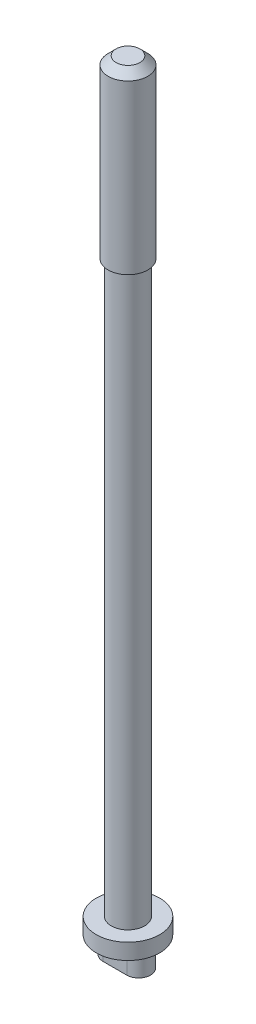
ISO-10303-21;
HEADER;
FILE_DESCRIPTION(('STEP AP214'),'2;1');
FILE_NAME('part.step','',(''),(''),'','','');
FILE_SCHEMA(('AUTOMOTIVE_DESIGN { 1 0 10303 214 1 1 1 1 }'));
ENDSEC;
DATA;
#1=APPLICATION_CONTEXT('core data for automotive mechanical design processes');
#2=APPLICATION_PROTOCOL_DEFINITION('international standard','automotive_design',2000,#1);
#3=PRODUCT_CONTEXT('',#1,'mechanical');
#4=PRODUCT('Part','Part','',(#3));
#5=PRODUCT_RELATED_PRODUCT_CATEGORY('part','',(#4));
#6=PRODUCT_DEFINITION_FORMATION('','',#4);
#7=PRODUCT_DEFINITION_CONTEXT('part definition',#1,'design');
#8=PRODUCT_DEFINITION('design','',#6,#7);
#9=PRODUCT_DEFINITION_SHAPE('','',#8);
#10=(LENGTH_UNIT() NAMED_UNIT(*) SI_UNIT(.MILLI.,.METRE.));
#11=(NAMED_UNIT(*) PLANE_ANGLE_UNIT() SI_UNIT($,.RADIAN.));
#12=(NAMED_UNIT(*) SI_UNIT($,.STERADIAN.) SOLID_ANGLE_UNIT());
#13=UNCERTAINTY_MEASURE_WITH_UNIT(LENGTH_MEASURE(1.E-05),#10,'distance_accuracy_value','');
#14=(GEOMETRIC_REPRESENTATION_CONTEXT(3) GLOBAL_UNCERTAINTY_ASSIGNED_CONTEXT((#13)) GLOBAL_UNIT_ASSIGNED_CONTEXT((#10,
#11,#12)) REPRESENTATION_CONTEXT('',''));
#15=CARTESIAN_POINT('',(0.,0.,0.));
#16=DIRECTION('',(0.,0.,1.));
#17=DIRECTION('',(1.,0.,0.));
#18=AXIS2_PLACEMENT_3D('',#15,#16,#17);
#19=CARTESIAN_POINT('',(-49.0306225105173,-89.7840104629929,0.));
#20=DIRECTION('',(0.,1.,0.));
#21=DIRECTION('',(0.,0.,1.));
#22=AXIS2_PLACEMENT_3D('',#19,#20,#21);
#23=PLANE('',#22);
#24=DIRECTION('',(1.,0.,0.));
#25=VECTOR('',#24,1.);
#26=CARTESIAN_POINT('',(-52.5566861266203,-89.7840104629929,1.50000000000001));
#27=LINE('',#26,#25);
#28=CARTESIAN_POINT('',(-52.5566861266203,-89.7840104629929,1.50000000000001));
#29=VERTEX_POINT('',#28);
#30=CARTESIAN_POINT('',(-49.5566861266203,-89.7840104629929,1.50000000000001));
#31=VERTEX_POINT('',#30);
#32=EDGE_CURVE('E57',#29,#31,#27,.T.);
#33=ORIENTED_EDGE('',*,*,#32,.F.);
#34=CARTESIAN_POINT('',(-52.5566861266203,-89.7840104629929,0.));
#35=DIRECTION('',(0.,-1.,0.));
#36=DIRECTION('',(0.,0.,-1.));
#37=AXIS2_PLACEMENT_3D('',#34,#35,#36);
#38=CIRCLE('',#37,1.5);
#39=CARTESIAN_POINT('',(-52.5566861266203,-89.7840104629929,-1.49999999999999));
#40=VERTEX_POINT('',#39);
#41=EDGE_CURVE('E20',#40,#29,#38,.F.);
#42=ORIENTED_EDGE('',*,*,#41,.F.);
#43=DIRECTION('',(-1.,0.,0.));
#44=VECTOR('',#43,1.);
#45=CARTESIAN_POINT('',(-49.5566861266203,-89.7840104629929,-1.49999999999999));
#46=LINE('',#45,#44);
#47=CARTESIAN_POINT('',(-49.5566861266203,-89.7840104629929,-1.49999999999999));
#48=VERTEX_POINT('',#47);
#49=EDGE_CURVE('E68',#48,#40,#46,.T.);
#50=ORIENTED_EDGE('',*,*,#49,.F.);
#51=CARTESIAN_POINT('',(-49.5566861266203,-89.7840104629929,0.));
#52=DIRECTION('',(0.,-1.,0.));
#53=DIRECTION('',(0.,0.,-1.));
#54=AXIS2_PLACEMENT_3D('',#51,#52,#53);
#55=CIRCLE('',#54,1.5);
#56=EDGE_CURVE('E59',#31,#48,#55,.F.);
#57=ORIENTED_EDGE('',*,*,#56,.F.);
#58=EDGE_LOOP('',(#33,#42,#50,#57));
#59=FACE_BOUND('',#58,.T.);
#60=ADVANCED_FACE('F16',(#59),#23,.F.);
#61=CARTESIAN_POINT('',(-49.5566861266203,-86.7840104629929,-1.49999999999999));
#62=DIRECTION('',(0.,0.,-1.));
#63=DIRECTION('',(-1.,0.,0.));
#64=AXIS2_PLACEMENT_3D('',#61,#62,#63);
#65=PLANE('',#64);
#66=DIRECTION('',(1.,0.,0.));
#67=VECTOR('',#66,1.);
#68=CARTESIAN_POINT('',(-52.9079596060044,-86.7840104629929,-1.49999999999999));
#69=LINE('',#68,#67);
#70=CARTESIAN_POINT('',(-49.5566861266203,-86.7840104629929,-1.49999999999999));
#71=VERTEX_POINT('',#70);
#72=CARTESIAN_POINT('',(-52.5566861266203,-86.7840104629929,-1.49999999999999));
#73=VERTEX_POINT('',#72);
#74=EDGE_CURVE('E99',#71,#73,#69,.F.);
#75=ORIENTED_EDGE('',*,*,#74,.F.);
#76=DIRECTION('',(0.,-1.,0.));
#77=VECTOR('',#76,1.);
#78=CARTESIAN_POINT('',(-49.5566861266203,-86.7840104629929,-1.49999999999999));
#79=LINE('',#78,#77);
#80=EDGE_CURVE('E74',#48,#71,#79,.F.);
#81=ORIENTED_EDGE('',*,*,#80,.F.);
#82=ORIENTED_EDGE('',*,*,#49,.T.);
#83=DIRECTION('',(0.,-1.,0.));
#84=VECTOR('',#83,1.);
#85=CARTESIAN_POINT('',(-52.5566861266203,-86.7840104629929,-1.49999999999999));
#86=LINE('',#85,#84);
#87=EDGE_CURVE('E62',#73,#40,#86,.T.);
#88=ORIENTED_EDGE('',*,*,#87,.F.);
#89=EDGE_LOOP('',(#75,#81,#82,#88));
#90=FACE_BOUND('',#89,.T.);
#91=ADVANCED_FACE('F196',(#90),#65,.T.);
#92=CARTESIAN_POINT('',(-52.5566861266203,-86.7840104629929,0.));
#93=DIRECTION('',(0.,-1.,0.));
#94=DIRECTION('',(0.,0.,-1.));
#95=AXIS2_PLACEMENT_3D('',#92,#93,#94);
#96=CYLINDRICAL_SURFACE('',#95,1.5);
#97=CARTESIAN_POINT('',(-52.5566861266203,-86.7840104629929,0.));
#98=DIRECTION('',(0.,-1.,0.));
#99=DIRECTION('',(0.,0.,-1.));
#100=AXIS2_PLACEMENT_3D('',#97,#98,#99);
#101=CIRCLE('',#100,1.5);
#102=CARTESIAN_POINT('',(-52.5566861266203,-86.7840104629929,1.50000000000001));
#103=VERTEX_POINT('',#102);
#104=EDGE_CURVE('E98',#73,#103,#101,.F.);
#105=ORIENTED_EDGE('',*,*,#104,.F.);
#106=ORIENTED_EDGE('',*,*,#87,.T.);
#107=ORIENTED_EDGE('',*,*,#41,.T.);
#108=DIRECTION('',(0.,1.,0.));
#109=VECTOR('',#108,1.);
#110=CARTESIAN_POINT('',(-52.5566861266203,-86.7840104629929,1.50000000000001));
#111=LINE('',#110,#109);
#112=EDGE_CURVE('E61',#103,#29,#111,.F.);
#113=ORIENTED_EDGE('',*,*,#112,.F.);
#114=EDGE_LOOP('',(#105,#106,#107,#113));
#115=FACE_BOUND('',#114,.T.);
#116=ADVANCED_FACE('F67',(#115),#96,.T.);
#117=CARTESIAN_POINT('',(-52.5566861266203,-86.7840104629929,1.50000000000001));
#118=DIRECTION('',(0.,0.,1.));
#119=DIRECTION('',(1.,0.,0.));
#120=AXIS2_PLACEMENT_3D('',#117,#118,#119);
#121=PLANE('',#120);
#122=DIRECTION('',(1.,0.,0.));
#123=VECTOR('',#122,1.);
#124=CARTESIAN_POINT('',(-52.9079596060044,-86.7840104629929,1.50000000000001));
#125=LINE('',#124,#123);
#126=CARTESIAN_POINT('',(-49.5566861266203,-86.7840104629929,1.50000000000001));
#127=VERTEX_POINT('',#126);
#128=EDGE_CURVE('E71',#103,#127,#125,.T.);
#129=ORIENTED_EDGE('',*,*,#128,.F.);
#130=ORIENTED_EDGE('',*,*,#112,.T.);
#131=ORIENTED_EDGE('',*,*,#32,.T.);
#132=DIRECTION('',(0.,-1.,0.));
#133=VECTOR('',#132,1.);
#134=CARTESIAN_POINT('',(-49.5566861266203,-86.7840104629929,1.50000000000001));
#135=LINE('',#134,#133);
#136=EDGE_CURVE('E35',#127,#31,#135,.T.);
#137=ORIENTED_EDGE('',*,*,#136,.F.);
#138=EDGE_LOOP('',(#129,#130,#131,#137));
#139=FACE_BOUND('',#138,.T.);
#140=ADVANCED_FACE('F69',(#139),#121,.T.);
#141=CARTESIAN_POINT('',(-49.5566861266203,-86.7840104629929,0.));
#142=DIRECTION('',(0.,-1.,0.));
#143=DIRECTION('',(0.,0.,-1.));
#144=AXIS2_PLACEMENT_3D('',#141,#142,#143);
#145=CYLINDRICAL_SURFACE('',#144,1.5);
#146=CARTESIAN_POINT('',(-49.5566861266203,-86.7840104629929,0.));
#147=DIRECTION('',(0.,-1.,0.));
#148=DIRECTION('',(0.,0.,-1.));
#149=AXIS2_PLACEMENT_3D('',#146,#147,#148);
#150=CIRCLE('',#149,1.5);
#151=EDGE_CURVE('E95',#127,#71,#150,.F.);
#152=ORIENTED_EDGE('',*,*,#151,.F.);
#153=ORIENTED_EDGE('',*,*,#136,.T.);
#154=ORIENTED_EDGE('',*,*,#56,.T.);
#155=ORIENTED_EDGE('',*,*,#80,.T.);
#156=EDGE_LOOP('',(#152,#153,#154,#155));
#157=FACE_BOUND('',#156,.T.);
#158=ADVANCED_FACE('F109',(#157),#145,.T.);
#159=CARTESIAN_POINT('',(-51.3401825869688,9.21598953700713,0.));
#160=DIRECTION('',(0.,1.,0.));
#161=DIRECTION('',(0.,0.,1.));
#162=AXIS2_PLACEMENT_3D('',#159,#160,#161);
#163=PLANE('',#162);
#164=CARTESIAN_POINT('',(-50.9079596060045,9.21598953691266,0.));
#165=DIRECTION('',(0.,-1.,0.));
#166=DIRECTION('',(0.,0.,-1.));
#167=AXIS2_PLACEMENT_3D('',#164,#165,#166);
#168=CIRCLE('',#167,1.50000000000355);
#169=CARTESIAN_POINT('',(-50.9079596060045,9.21598953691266,-1.50000000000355));
#170=VERTEX_POINT('',#169);
#171=EDGE_CURVE('E92',#170,#170,#168,.T.);
#172=ORIENTED_EDGE('',*,*,#171,.F.);
#173=EDGE_LOOP('',(#172));
#174=FACE_BOUND('',#173,.T.);
#175=ADVANCED_FACE('F114',(#174),#163,.T.);
#176=CARTESIAN_POINT('',(-52.9079596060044,-86.7840104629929,0.));
#177=DIRECTION('',(0.,-1.,0.));
#178=DIRECTION('',(1.,0.,0.));
#179=AXIS2_PLACEMENT_3D('',#176,#177,#178);
#180=PLANE('',#179);
#181=CARTESIAN_POINT('',(-50.9079596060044,-86.7840104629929,0.));
#182=DIRECTION('',(0.,1.,0.));
#183=DIRECTION('',(-1.,0.,0.));
#184=AXIS2_PLACEMENT_3D('',#181,#182,#183);
#185=CIRCLE('',#184,4.00000000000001);
#186=CARTESIAN_POINT('',(-54.9079596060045,-86.7840104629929,0.));
#187=VERTEX_POINT('',#186);
#188=EDGE_CURVE('E89',#187,#187,#185,.T.);
#189=ORIENTED_EDGE('',*,*,#188,.F.);
#190=EDGE_LOOP('',(#189));
#191=FACE_BOUND('',#190,.T.);
#192=ORIENTED_EDGE('',*,*,#128,.T.);
#193=ORIENTED_EDGE('',*,*,#151,.T.);
#194=ORIENTED_EDGE('',*,*,#74,.T.);
#195=ORIENTED_EDGE('',*,*,#104,.T.);
#196=EDGE_LOOP('',(#192,#193,#194,#195));
#197=FACE_BOUND('',#196,.T.);
#198=ADVANCED_FACE('F111',(#191,#197),#180,.T.);
#199=CARTESIAN_POINT('',(-50.9079596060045,8.21598953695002,0.));
#200=DIRECTION('',(0.,-1.,0.));
#201=DIRECTION('',(0.,0.,-1.));
#202=AXIS2_PLACEMENT_3D('',#199,#200,#201);
#203=CONICAL_SURFACE('',#202,2.50000000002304,0.78539816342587);
#204=CARTESIAN_POINT('',(-50.9079596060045,8.21598953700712,0.));
#205=DIRECTION('',(0.,1.,0.));
#206=DIRECTION('',(-1.,0.,0.));
#207=AXIS2_PLACEMENT_3D('',#204,#205,#206);
#208=CIRCLE('',#207,2.5);
#209=CARTESIAN_POINT('',(-53.4079596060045,8.21598953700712,0.));
#210=VERTEX_POINT('',#209);
#211=EDGE_CURVE('E88',#210,#210,#208,.F.);
#212=ORIENTED_EDGE('',*,*,#211,.F.);
#213=EDGE_LOOP('',(#212));
#214=FACE_BOUND('',#213,.T.);
#215=ORIENTED_EDGE('',*,*,#171,.T.);
#216=EDGE_LOOP('',(#215));
#217=FACE_BOUND('',#216,.T.);
#218=ADVANCED_FACE('F113',(#214,#217),#203,.T.);
#219=CARTESIAN_POINT('',(-50.9079596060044,-85.7840104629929,0.));
#220=DIRECTION('',(0.,1.,0.));
#221=DIRECTION('',(-1.,0.,0.));
#222=AXIS2_PLACEMENT_3D('',#219,#220,#221);
#223=CYLINDRICAL_SURFACE('',#222,4.00000000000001);
#224=CARTESIAN_POINT('',(-50.9079596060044,-84.7840104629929,0.));
#225=DIRECTION('',(0.,1.,0.));
#226=DIRECTION('',(-1.,0.,0.));
#227=AXIS2_PLACEMENT_3D('',#224,#225,#226);
#228=CIRCLE('',#227,4.00000000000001);
#229=CARTESIAN_POINT('',(-54.9079596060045,-84.7840104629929,0.));
#230=VERTEX_POINT('',#229);
#231=EDGE_CURVE('E85',#230,#230,#228,.T.);
#232=ORIENTED_EDGE('',*,*,#231,.F.);
#233=EDGE_LOOP('',(#232));
#234=FACE_BOUND('',#233,.T.);
#235=ORIENTED_EDGE('',*,*,#188,.T.);
#236=EDGE_LOOP('',(#235));
#237=FACE_BOUND('',#236,.T.);
#238=ADVANCED_FACE('F122',(#234,#237),#223,.T.);
#239=CARTESIAN_POINT('',(-50.9079596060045,-1.86239348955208,0.));
#240=DIRECTION('',(0.,1.,0.));
#241=DIRECTION('',(-1.,0.,0.));
#242=AXIS2_PLACEMENT_3D('',#239,#240,#241);
#243=CYLINDRICAL_SURFACE('',#242,2.5);
#244=ORIENTED_EDGE('',*,*,#211,.T.);
#245=EDGE_LOOP('',(#244));
#246=FACE_BOUND('',#245,.T.);
#247=CARTESIAN_POINT('',(-50.9079596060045,-12.9407765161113,0.));
#248=DIRECTION('',(0.,1.,0.));
#249=DIRECTION('',(-1.,0.,0.));
#250=AXIS2_PLACEMENT_3D('',#247,#248,#249);
#251=CIRCLE('',#250,2.5);
#252=CARTESIAN_POINT('',(-53.4079596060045,-12.9407765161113,0.));
#253=VERTEX_POINT('',#252);
#254=EDGE_CURVE('E82',#253,#253,#251,.F.);
#255=ORIENTED_EDGE('',*,*,#254,.F.);
#256=EDGE_LOOP('',(#255));
#257=FACE_BOUND('',#256,.T.);
#258=ADVANCED_FACE('F142',(#246,#257),#243,.T.);
#259=CARTESIAN_POINT('',(-53.9579596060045,-84.7840104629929,0.));
#260=DIRECTION('',(0.,1.,0.));
#261=DIRECTION('',(0.,0.,1.));
#262=AXIS2_PLACEMENT_3D('',#259,#260,#261);
#263=PLANE('',#262);
#264=ORIENTED_EDGE('',*,*,#231,.T.);
#265=EDGE_LOOP('',(#264));
#266=FACE_BOUND('',#265,.T.);
#267=CARTESIAN_POINT('',(-50.9079596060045,-84.7840104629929,0.));
#268=DIRECTION('',(0.,1.,0.));
#269=DIRECTION('',(-1.,0.,0.));
#270=AXIS2_PLACEMENT_3D('',#267,#268,#269);
#271=CIRCLE('',#270,2.10000000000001);
#272=CARTESIAN_POINT('',(-53.0079596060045,-84.7840104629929,0.));
#273=VERTEX_POINT('',#272);
#274=EDGE_CURVE('E26',#273,#273,#271,.T.);
#275=ORIENTED_EDGE('',*,*,#274,.F.);
#276=EDGE_LOOP('',(#275));
#277=FACE_BOUND('',#276,.T.);
#278=ADVANCED_FACE('F134',(#266,#277),#263,.T.);
#279=CARTESIAN_POINT('',(-53.2079596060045,-12.9407765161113,0.));
#280=DIRECTION('',(0.,-1.,0.));
#281=DIRECTION('',(1.,0.,0.));
#282=AXIS2_PLACEMENT_3D('',#279,#280,#281);
#283=PLANE('',#282);
#284=CARTESIAN_POINT('',(-50.9079596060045,-12.9407765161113,0.));
#285=DIRECTION('',(0.,1.,0.));
#286=DIRECTION('',(-1.,0.,0.));
#287=AXIS2_PLACEMENT_3D('',#284,#285,#286);
#288=CIRCLE('',#287,2.10000000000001);
#289=CARTESIAN_POINT('',(-53.0079596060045,-12.9407765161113,0.));
#290=VERTEX_POINT('',#289);
#291=EDGE_CURVE('E10',#290,#290,#288,.F.);
#292=ORIENTED_EDGE('',*,*,#291,.F.);
#293=EDGE_LOOP('',(#292));
#294=FACE_BOUND('',#293,.T.);
#295=ORIENTED_EDGE('',*,*,#254,.T.);
#296=EDGE_LOOP('',(#295));
#297=FACE_BOUND('',#296,.T.);
#298=ADVANCED_FACE('F129',(#294,#297),#283,.T.);
#299=CARTESIAN_POINT('',(-50.9079596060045,-48.8623934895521,0.));
#300=DIRECTION('',(0.,1.,0.));
#301=DIRECTION('',(-1.,0.,0.));
#302=AXIS2_PLACEMENT_3D('',#299,#300,#301);
#303=CYLINDRICAL_SURFACE('',#302,2.10000000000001);
#304=ORIENTED_EDGE('',*,*,#274,.T.);
#305=EDGE_LOOP('',(#304));
#306=FACE_BOUND('',#305,.T.);
#307=ORIENTED_EDGE('',*,*,#291,.T.);
#308=EDGE_LOOP('',(#307));
#309=FACE_BOUND('',#308,.T.);
#310=ADVANCED_FACE('F18',(#306,#309),#303,.T.);
#311=CLOSED_SHELL('',(#60,#91,#116,#140,#158,#175,#198,#218,#238,#258,#278,#298,#310));
#312=MANIFOLD_SOLID_BREP('B1',#311);
#313=ADVANCED_BREP_SHAPE_REPRESENTATION('',(#18,#312),#14);
#314=SHAPE_DEFINITION_REPRESENTATION(#9,#313);
ENDSEC;
END-ISO-10303-21;
